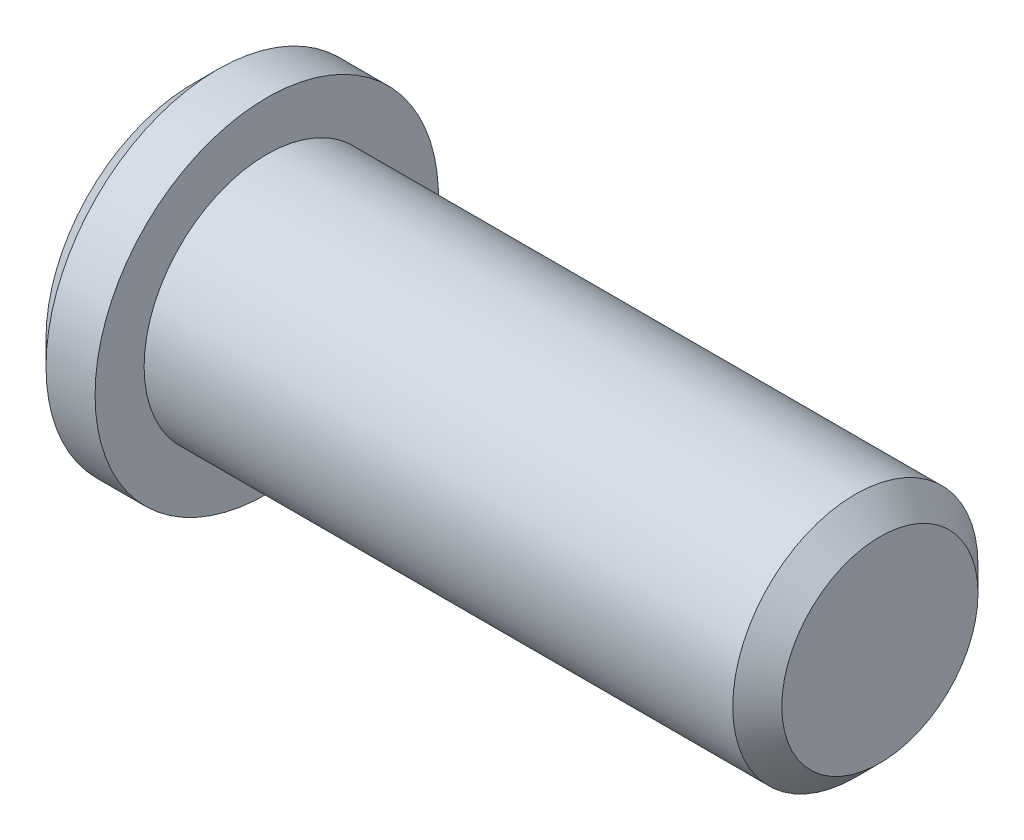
from build123d import *

# Parameters (mm, degrees)
CHAMFER_1_SIZE = 1


with BuildPart() as part:
    # Sketch 1 → Revolve 1 (revolve)
    with BuildSketch(Plane.XY, mode=Mode.PRIVATE) as revolve_1_sk:
        Polygon((-37.154411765, 5), (-12.154411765, 5), (-12.154411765, 0), (-40.154411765, 0), (-40.154411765, 7), (-37.154411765, 7), align=None)
    revolve(revolve_1_sk.sketch.rotate(Axis((-84.230882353, 0, 0), (1, 0, 0)), 90), axis=Axis((-84.230882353, 0, 0), (1, 0, 0)))

    # Chamfer 1
    chamfer_1_edges = [part.edges().sort_by_distance(p)[0] for p in [
        (-12.154411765, 0, -5),
        (-40.154411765, 0, -7),
    ]]
    chamfer(chamfer_1_edges, length=CHAMFER_1_SIZE)


solid = part.part
